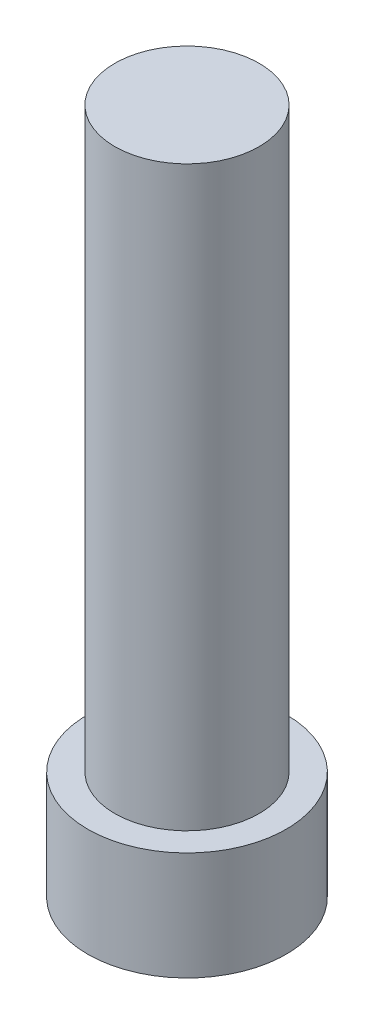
from build123d import *

# Parameters (mm, degrees)
SKETCH_1_R          = 2.75
EXTRUDE_1_DEPTH     = 3
SKETCH_2_R          = 2
EXTRUDE_2_DEPTH     = 16
CUT_EXTRUDE_1_DEPTH = 1.5


with BuildPart() as part:
    # Sketch 1 → Extrude 1 (new body)
    with BuildSketch(Plane(origin=(0, 0, 0), x_dir=(1, 0, 0), z_dir=(0, 1, 0))):
        with Locations(Location((0, 0, 0), (0, 0, 270))):
            Circle(SKETCH_1_R)
    extrude(amount=EXTRUDE_1_DEPTH)

    # Sketch 2 → Extrude 2 (add)
    with BuildSketch(Plane(origin=(0, 3, 0), x_dir=(1, 0, 0), z_dir=(0, 1, 0))):
        with Locations(Location((0, 0, 0), (0, 0, 270))):
            Circle(SKETCH_2_R)
    extrude(amount=EXTRUDE_2_DEPTH)

    # Sketch 3 → Cut-Extrude 1 (cut)
    with BuildSketch(Plane.XZ):
        Polygon((1.091681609, -0.944226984), (1.36356536, 0.473310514), (0.271883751, 1.417537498), (-1.091681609, 0.944226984), (-1.36356536, -0.473310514), (-0.271883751, -1.417537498), align=None)
    extrude(amount=-CUT_EXTRUDE_1_DEPTH, mode=Mode.SUBTRACT)


solid = part.part
